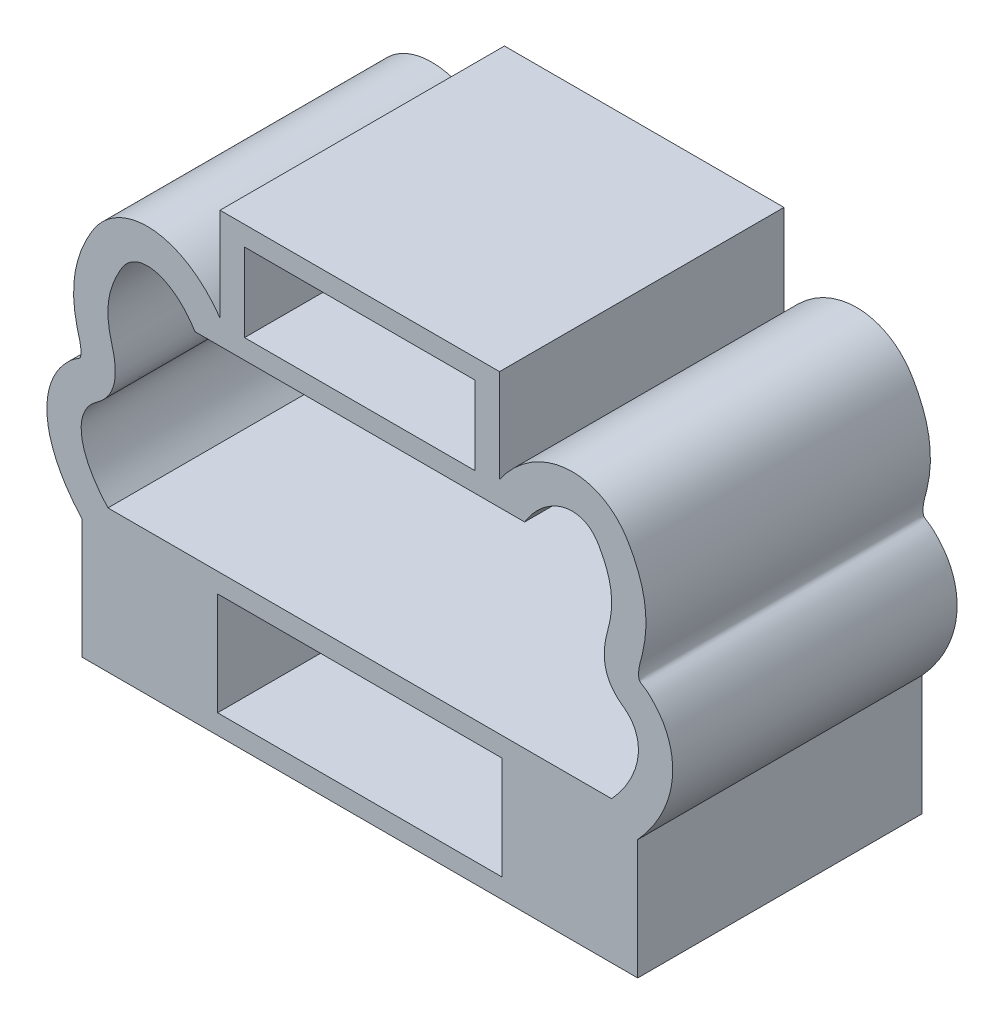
from build123d import *

# Parameters (mm, degrees)
EXTRUDE_1_DEPTH = 5.8


with BuildPart() as part:
    # Model → Extrude 1 (new body)
    with BuildSketch(Plane.XY):
        with BuildLine():
            Line((5.13576921, 0), (0, 0))
            add(Edge.make_bspline(
                [(0, 0), (-0.044844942, 0.050812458), (-0.089689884, 0.101624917), (-0.132153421, 0.154398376), (-0.174039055, 0.20645362), (-0.213607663, 0.260416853), (-0.250990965, 0.315843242), (-0.287378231, 0.369792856), (-0.32169509, 0.425128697), (-0.353266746, 0.482016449), (-0.383593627, 0.536661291), (-0.411387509, 0.592738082), (-0.436014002, 0.650193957), (-0.459383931, 0.704718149), (-0.479901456, 0.760484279), (-0.4967588, 0.817368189), (-0.512602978, 0.870833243), (-0.525213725, 0.925285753), (-0.533712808, 0.980410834), (-0.541660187, 1.031957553), (-0.546012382, 1.08409236), (-0.54591785, 1.136259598), (-0.545829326, 1.185111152), (-0.541841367, 1.233991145), (-0.533320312, 1.282106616), (-0.525265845, 1.327587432), (-0.513161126, 1.372385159), (-0.496764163, 1.41556472), (-0.481008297, 1.457056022), (-0.461289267, 1.497053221), (-0.437904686, 1.534791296), (-0.41498451, 1.571779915), (-0.38854293, 1.606598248), (-0.359057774, 1.638557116), (-0.329631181, 1.670452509), (-0.29717309, 1.699499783), (-0.263008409, 1.726257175), (-0.2295799, 1.752438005), (-0.194517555, 1.776426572), (-0.161632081, 1.803188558), (-0.131627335, 1.827606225), (-0.103434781, 1.854332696), (-0.076888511, 1.882567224), (-0.052282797, 1.908737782), (-0.029091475, 1.936203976), (-0.007842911, 1.96512653), (0.012288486, 1.992528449), (0.03067604, 2.021237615), (0.047105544, 2.051021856), (0.063031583, 2.07989339), (0.077117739, 2.109775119), (0.089258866, 2.140425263), (0.101289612, 2.170796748), (0.111410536, 2.201922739), (0.1196767, 2.233526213), (0.128028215, 2.265456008), (0.134486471, 2.297873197), (0.139219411, 2.330532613), (0.144077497, 2.364055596), (0.147117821, 2.397833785), (0.148581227, 2.431672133), (0.150101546, 2.466826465), (0.149919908, 2.502045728), (0.148315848, 2.537193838), (0.146634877, 2.574027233), (0.14339181, 2.610782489), (0.138856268, 2.647370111), (0.134074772, 2.685941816), (0.127856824, 2.724327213), (0.120530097, 2.762498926), (0.112775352, 2.802900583), (0.103778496, 2.843062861), (0.093571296, 2.88290647), (0.082907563, 2.924532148), (0.070922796, 2.965810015), (0.06025564, 3.007434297), (0.050053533, 3.047243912), (0.041056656, 3.087370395), (0.033219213, 3.127720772), (0.025762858, 3.166109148), (0.019355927, 3.204700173), (0.014214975, 3.243463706), (0.009266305, 3.280777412), (0.005490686, 3.318250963), (0.003003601, 3.355811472), (0.000578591, 3.392434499), (-0.000621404, 3.429140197), (-0.000502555, 3.465843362), (-0.000385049, 3.502132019), (0.00102168, 3.538418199), (0.003758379, 3.574604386), (0.006504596, 3.610916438), (0.010590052, 3.6471278), (0.016002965, 3.683138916), (0.021519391, 3.719838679), (0.028414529, 3.756330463), (0.036615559, 3.792525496), (0.045106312, 3.829999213), (0.054996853, 3.867154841), (0.066170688, 3.903915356), (0.077922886, 3.942578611), (0.091094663, 3.980804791), (0.105467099, 4.018577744), (0.12081895, 4.058924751), (0.137540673, 4.098754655), (0.155577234, 4.137956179), (0.175134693, 4.180463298), (0.196238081, 4.222231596), (0.217918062, 4.263741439), (0.241662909, 4.309204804), (0.266099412, 4.354358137), (0.294656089, 4.396980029), (0.323364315, 4.439828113), (0.356236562, 4.480117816), (0.393739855, 4.515619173), (0.430346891, 4.550272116), (0.471366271, 4.580362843), (0.515612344, 4.604566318), (0.559593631, 4.628624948), (0.606763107, 4.646866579), (0.655435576, 4.658809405), (0.704858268, 4.670936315), (0.755830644, 4.676568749), (0.806705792, 4.676385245), (0.859000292, 4.676196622), (0.911192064, 4.669863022), (0.962228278, 4.658596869), (1.014594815, 4.64703705), (1.065744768, 4.630284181), (1.115170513, 4.609541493), (1.165243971, 4.588526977), (1.213547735, 4.563417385), (1.259896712, 4.535159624), (1.306012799, 4.507043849), (1.350193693, 4.475811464), (1.392413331, 4.442142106), (1.433630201, 4.409272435), (1.472977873, 4.37408018), (1.510421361, 4.336991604), (1.546343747, 4.301409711), (1.580513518, 4.26408244), (1.613087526, 4.225395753), (1.643880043, 4.188824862), (1.673246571, 4.151039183), (1.700680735, 4.111927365), (1.726309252, 4.075389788), (1.7502514, 4.037694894), (1.774193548, 4)],
                knots=[0, 0, 0, 0, 0.203232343, 0.203232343, 0.203232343, 0.403698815, 0.403698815, 0.403698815, 0.598824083, 0.598824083, 0.598824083, 0.786256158, 0.786256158, 0.786256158, 0.964124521, 0.964124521, 0.964124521, 1.131302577, 1.131302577, 1.131302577, 1.28762852, 1.28762852, 1.28762852, 1.434018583, 1.434018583, 1.434018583, 1.572392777, 1.572392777, 1.572392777, 1.705356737, 1.705356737, 1.705356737, 1.835680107, 1.835680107, 1.835680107, 1.965744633, 1.965744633, 1.965744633, 2.093006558, 2.093006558, 2.093006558, 2.209120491, 2.209120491, 2.209120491, 2.316746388, 2.316746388, 2.316746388, 2.418713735, 2.418713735, 2.418713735, 2.517556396, 2.517556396, 2.517556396, 2.615500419, 2.615500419, 2.615500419, 2.714455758, 2.714455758, 2.714455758, 2.816027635, 2.816027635, 2.816027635, 2.921549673, 2.921549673, 2.921549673, 3.032131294, 3.032131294, 3.032131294, 3.148709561, 3.148709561, 3.148709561, 3.27209819, 3.27209819, 3.27209819, 3.40100557, 3.40100557, 3.40100557, 3.524293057, 3.524293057, 3.524293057, 3.641585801, 3.641585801, 3.641585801, 3.754491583, 3.754491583, 3.754491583, 3.86457932, 3.86457932, 3.86457932, 3.973423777, 3.973423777, 3.973423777, 4.082646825, 4.082646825, 4.082646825, 4.193958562, 4.193958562, 4.193958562, 4.309202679, 4.309202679, 4.309202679, 4.430411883, 4.430411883, 4.430411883, 4.559880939, 4.559880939, 4.559880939, 4.700267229, 4.700267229, 4.700267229, 4.854024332, 4.854024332, 4.854024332, 5.00859742, 5.00859742, 5.00859742, 5.159476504, 5.159476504, 5.159476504, 5.309452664, 5.309452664, 5.309452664, 5.461740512, 5.461740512, 5.461740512, 5.618276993, 5.618276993, 5.618276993, 5.778893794, 5.778893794, 5.778893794, 5.941615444, 5.941615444, 5.941615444, 6.103519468, 6.103519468, 6.103519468, 6.261578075, 6.261578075, 6.261578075, 6.413215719, 6.413215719, 6.413215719, 6.556560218, 6.556560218, 6.556560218, 6.690470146, 6.690470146, 6.690470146, 6.690470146], degree=3))
            Line((1.774193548, 4), (5.13576921, 4))
            Line((5.13576921, 4), (5.13576921, 4.4))
            Line((5.13576921, 4.4), (2.78576921, 4.4))
            Line((2.78576921, 4.4), (2.78576921, 6))
            Line((2.78576921, 6), (5.13576921, 6))
            Line((5.13576921, 6), (5.13576921, 6.4))
            Line((5.13576921, 6.4), (2.28576921, 6.4))
            Line((2.28576921, 6.4), (2.28576921, 4.496207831))
            add(Edge.make_bspline(
                [(2.28576921, 4.496207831), (2.24710857, 4.549204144), (2.208447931, 4.602200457), (2.167192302, 4.653143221), (2.122723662, 4.708053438), (2.075240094, 4.760577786), (2.02557771, 4.81092613), (1.972308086, 4.86493154), (1.916531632, 4.916433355), (1.858097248, 4.964768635), (1.795697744, 5.016383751), (1.73026736, 5.064388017), (1.66206252, 5.108101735), (1.589433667, 5.154650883), (1.513658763, 5.196334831), (1.435148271, 5.232128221), (1.351561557, 5.270235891), (1.264874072, 5.301666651), (1.176021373, 5.325149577), (1.081297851, 5.350184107), (0.984113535, 5.36618582), (0.886251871, 5.37185086), (0.782188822, 5.377874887), (0.67735986, 5.372210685), (0.574647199, 5.354131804), (0.467061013, 5.335195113), (0.361796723, 5.302637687), (0.262437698, 5.257178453), (0.161549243, 5.211019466), (0.066749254, 5.151558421), (-0.018928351, 5.081043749), (-0.102733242, 5.012070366), (-0.177810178, 4.932521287), (-0.242613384, 4.845690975), (-0.297427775, 4.772244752), (-0.344891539, 4.693588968), (-0.388668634, 4.613101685), (-0.418005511, 4.559163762), (-0.44568674, 4.50440333), (-0.471618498, 4.448802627), (-0.496041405, 4.396437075), (-0.518912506, 4.34332619), (-0.53997597, 4.289508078), (-0.560421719, 4.237268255), (-0.5791643, 4.184362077), (-0.59602054, 4.130857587), (-0.612528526, 4.078458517), (-0.627227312, 4.025485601), (-0.63997344, 3.972045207), (-0.652538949, 3.91936209), (-0.663206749, 3.86622465), (-0.671890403, 3.8127642), (-0.680492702, 3.759804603), (-0.687147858, 3.70652802), (-0.691828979, 3.653078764), (-0.69648433, 3.599923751), (-0.69918732, 3.54659796), (-0.699965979, 3.493246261), (-0.700743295, 3.439986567), (-0.699602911, 3.386701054), (-0.696641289, 3.333517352), (-0.693671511, 3.280187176), (-0.688870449, 3.226959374), (-0.682325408, 3.173954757), (-0.675724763, 3.120499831), (-0.667350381, 3.067271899), (-0.657531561, 3.014303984), (-0.647557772, 2.960500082), (-0.63609359, 2.906964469), (-0.622705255, 2.853927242), (-0.609887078, 2.803148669), (-0.595305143, 2.752826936), (-0.582646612, 2.701993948), (-0.57502585, 2.671391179), (-0.568102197, 2.640603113), (-0.562557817, 2.609558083), (-0.558282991, 2.585621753), (-0.554828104, 2.561532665), (-0.552440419, 2.537329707), (-0.550472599, 2.517382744), (-0.549229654, 2.497358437), (-0.549118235, 2.477313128), (-0.549030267, 2.461486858), (-0.549647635, 2.445647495), (-0.551416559, 2.429911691), (-0.552737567, 2.418160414), (-0.554700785, 2.406466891), (-0.55780093, 2.395051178), (-0.559976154, 2.387041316), (-0.562711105, 2.379168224), (-0.566536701, 2.371769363), (-0.569141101, 2.366732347), (-0.572250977, 2.36191512), (-0.576127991, 2.357819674), (-0.579085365, 2.354695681), (-0.582489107, 2.351991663), (-0.58604601, 2.349550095), (-0.589775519, 2.346990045), (-0.593673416, 2.344718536), (-0.597509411, 2.342344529), (-0.603044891, 2.33891875), (-0.608451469, 2.335279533), (-0.613855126, 2.331640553), (-0.622606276, 2.325747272), (-0.631349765, 2.319854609), (-0.640171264, 2.314070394), (-0.655510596, 2.304012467), (-0.671085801, 2.294282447), (-0.68616693, 2.283874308), (-0.739227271, 2.247255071), (-0.786171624, 2.202241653), (-0.831054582, 2.155489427), (-0.890549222, 2.093516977), (-0.946421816, 2.028489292), (-0.995257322, 1.958298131), (-1.045936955, 1.885456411), (-1.089037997, 1.807053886), (-1.124442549, 1.725435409), (-1.160567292, 1.642156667), (-1.188679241, 1.555529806), (-1.208451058, 1.467034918), (-1.22830012, 1.37819429), (-1.239743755, 1.28747101), (-1.243321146, 1.196497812), (-1.246875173, 1.106118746), (-1.242665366, 1.015493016), (-1.231576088, 0.925758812), (-1.22059959, 0.83693723), (-1.202882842, 0.748989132), (-1.179443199, 0.662636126), (-1.156230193, 0.577118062), (-1.127404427, 0.493164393), (-1.093927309, 0.411133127), (-1.060730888, 0.32978967), (-1.02296079, 0.250336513), (-0.981356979, 0.172981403), (-0.940106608, 0.096283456), (-0.895087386, 0.021648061), (-0.847127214, -0.051064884), (-0.799680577, -0.122999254), (-0.749355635, -0.193052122), (-0.6958956, -0.260565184), (-0.643225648, -0.327080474), (-0.587512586, -0.391130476), (-0.531799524, -0.455180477)],
                knots=[-8.841702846, -8.841702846, -8.841702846, -8.841702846, -8.645007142, -8.645007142, -8.645007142, -8.432992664, -8.432992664, -8.432992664, -8.205578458, -8.205578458, -8.205578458, -7.962732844, -7.962732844, -7.962732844, -7.704135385, -7.704135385, -7.704135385, -7.428817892, -7.428817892, -7.428817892, -7.135309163, -7.135309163, -7.135309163, -6.82320111, -6.82320111, -6.82320111, -6.49628411, -6.49628411, -6.49628411, -6.164334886, -6.164334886, -6.164334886, -5.839641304, -5.839641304, -5.839641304, -5.564996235, -5.564996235, -5.564996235, -5.38094499, -5.38094499, -5.38094499, -5.207602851, -5.207602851, -5.207602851, -5.039344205, -5.039344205, -5.039344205, -4.874561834, -4.874561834, -4.874561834, -4.712114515, -4.712114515, -4.712114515, -4.551189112, -4.551189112, -4.551189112, -4.391149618, -4.391149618, -4.391149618, -4.231386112, -4.231386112, -4.231386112, -4.071182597, -4.071182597, -4.071182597, -3.909618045, -3.909618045, -3.909618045, -3.74550354, -3.74550354, -3.74550354, -3.588378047, -3.588378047, -3.588378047, -3.493784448, -3.493784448, -3.493784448, -3.420850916, -3.420850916, -3.420850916, -3.360742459, -3.360742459, -3.360742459, -3.313285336, -3.313285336, -3.313285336, -3.277845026, -3.277845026, -3.277845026, -3.252978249, -3.252978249, -3.252978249, -3.236049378, -3.236049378, -3.236049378, -3.223136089, -3.223136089, -3.223136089, -3.209596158, -3.209596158, -3.209596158, -3.190057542, -3.190057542, -3.190057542, -3.158415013, -3.158415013, -3.158415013, -3.103393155, -3.103393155, -3.103393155, -2.909808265, -2.909808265, -2.909808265, -2.653201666, -2.653201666, -2.653201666, -2.386905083, -2.386905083, -2.386905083, -2.115191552, -2.115191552, -2.115191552, -1.842416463, -1.842416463, -1.842416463, -1.571422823, -1.571422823, -1.571422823, -1.303185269, -1.303185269, -1.303185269, -1.037541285, -1.037541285, -1.037541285, -0.774124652, -0.774124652, -0.774124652, -0.512945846, -0.512945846, -0.512945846, -0.254563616, -0.254563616, -0.254563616, 0, 0, 0, 0], degree=3))
            Line((-0.531799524, -0.455180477), (-0.531799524, -2.9))
            Line((-0.531799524, -2.9), (5.13576921, -2.9))
            Line((5.13576921, -2.9), (5.13576921, -2.5))
            Line((5.13576921, -2.5), (2.23576921, -2.5))
            Line((2.23576921, -2.5), (2.23576921, -0.4))
            Line((2.23576921, -0.4), (5.13576921, -0.4))
            Line((5.13576921, -0.4), (5.13576921, 0))
        make_face()
    extrude_1 = extrude(amount=EXTRUDE_1_DEPTH)

    # Mirror 1: Extrude 1 across plane
    add(extrude_1.mirror(Plane(origin=(5.13576921, 0, 0), x_dir=(0, 0, 1), z_dir=(1, 0, 0))))


solid = part.part
